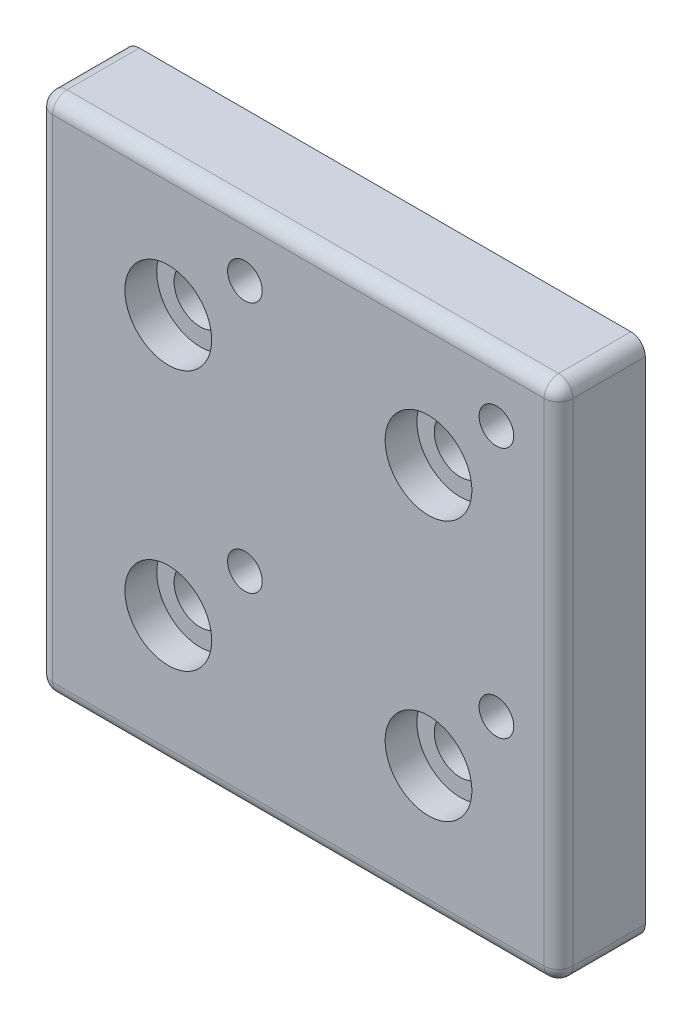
ISO-10303-21;
HEADER;
FILE_DESCRIPTION(('STEP AP214'),'2;1');
FILE_NAME('part.step','',(''),(''),'','','');
FILE_SCHEMA(('AUTOMOTIVE_DESIGN { 1 0 10303 214 1 1 1 1 }'));
ENDSEC;
DATA;
#1=APPLICATION_CONTEXT('core data for automotive mechanical design processes');
#2=APPLICATION_PROTOCOL_DEFINITION('international standard','automotive_design',2000,#1);
#3=PRODUCT_CONTEXT('',#1,'mechanical');
#4=PRODUCT('Part','Part','',(#3));
#5=PRODUCT_RELATED_PRODUCT_CATEGORY('part','',(#4));
#6=PRODUCT_DEFINITION_FORMATION('','',#4);
#7=PRODUCT_DEFINITION_CONTEXT('part definition',#1,'design');
#8=PRODUCT_DEFINITION('design','',#6,#7);
#9=PRODUCT_DEFINITION_SHAPE('','',#8);
#10=(LENGTH_UNIT() NAMED_UNIT(*) SI_UNIT(.MILLI.,.METRE.));
#11=(NAMED_UNIT(*) PLANE_ANGLE_UNIT() SI_UNIT($,.RADIAN.));
#12=(NAMED_UNIT(*) SI_UNIT($,.STERADIAN.) SOLID_ANGLE_UNIT());
#13=UNCERTAINTY_MEASURE_WITH_UNIT(LENGTH_MEASURE(1.E-05),#10,'distance_accuracy_value','');
#14=(GEOMETRIC_REPRESENTATION_CONTEXT(3) GLOBAL_UNCERTAINTY_ASSIGNED_CONTEXT((#13)) GLOBAL_UNIT_ASSIGNED_CONTEXT((#10,
#11,#12)) REPRESENTATION_CONTEXT('',''));
#15=CARTESIAN_POINT('',(0.,0.,0.));
#16=DIRECTION('',(0.,0.,1.));
#17=DIRECTION('',(1.,0.,0.));
#18=AXIS2_PLACEMENT_3D('',#15,#16,#17);
#19=CARTESIAN_POINT('',(-22.5,22.5,15.));
#20=DIRECTION('',(0.,0.,-1.));
#21=DIRECTION('',(-1.,0.,0.));
#22=AXIS2_PLACEMENT_3D('',#19,#20,#21);
#23=CYLINDRICAL_SURFACE('',#22,7.50000000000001);
#24=CARTESIAN_POINT('',(-22.5,22.5,9.5));
#25=DIRECTION('',(0.,0.,-1.));
#26=DIRECTION('',(-1.,0.,0.));
#27=AXIS2_PLACEMENT_3D('',#24,#25,#26);
#28=CIRCLE('',#27,7.50000000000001);
#29=CARTESIAN_POINT('',(-30.,22.5,9.5));
#30=VERTEX_POINT('',#29);
#31=EDGE_CURVE('E127',#30,#30,#28,.T.);
#32=ORIENTED_EDGE('',*,*,#31,.T.);
#33=EDGE_LOOP('',(#32));
#34=FACE_BOUND('',#33,.T.);
#35=CARTESIAN_POINT('',(-22.5,22.5,15.));
#36=DIRECTION('',(0.,0.,-1.));
#37=DIRECTION('',(-1.,0.,0.));
#38=AXIS2_PLACEMENT_3D('',#35,#36,#37);
#39=CIRCLE('',#38,7.50000000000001);
#40=CARTESIAN_POINT('',(-30.,22.5,15.));
#41=VERTEX_POINT('',#40);
#42=EDGE_CURVE('E133',#41,#41,#39,.T.);
#43=ORIENTED_EDGE('',*,*,#42,.F.);
#44=EDGE_LOOP('',(#43));
#45=FACE_BOUND('',#44,.T.);
#46=ADVANCED_FACE('F15',(#34,#45),#23,.F.);
#47=CARTESIAN_POINT('',(22.5,22.5,15.));
#48=DIRECTION('',(0.,0.,-1.));
#49=DIRECTION('',(-1.,0.,0.));
#50=AXIS2_PLACEMENT_3D('',#47,#48,#49);
#51=CYLINDRICAL_SURFACE('',#50,7.5);
#52=CARTESIAN_POINT('',(22.5,22.5,9.5));
#53=DIRECTION('',(0.,0.,-1.));
#54=DIRECTION('',(-1.,0.,0.));
#55=AXIS2_PLACEMENT_3D('',#52,#53,#54);
#56=CIRCLE('',#55,7.5);
#57=CARTESIAN_POINT('',(15.,22.5,9.5));
#58=VERTEX_POINT('',#57);
#59=EDGE_CURVE('E124',#58,#58,#56,.T.);
#60=ORIENTED_EDGE('',*,*,#59,.T.);
#61=EDGE_LOOP('',(#60));
#62=FACE_BOUND('',#61,.T.);
#63=CARTESIAN_POINT('',(22.5,22.5,15.));
#64=DIRECTION('',(0.,0.,-1.));
#65=DIRECTION('',(-1.,0.,0.));
#66=AXIS2_PLACEMENT_3D('',#63,#64,#65);
#67=CIRCLE('',#66,7.5);
#68=CARTESIAN_POINT('',(15.,22.5,15.));
#69=VERTEX_POINT('',#68);
#70=EDGE_CURVE('E130',#69,#69,#67,.T.);
#71=ORIENTED_EDGE('',*,*,#70,.F.);
#72=EDGE_LOOP('',(#71));
#73=FACE_BOUND('',#72,.T.);
#74=ADVANCED_FACE('F418',(#62,#73),#51,.F.);
#75=CARTESIAN_POINT('',(-22.5,-22.5,15.));
#76=DIRECTION('',(0.,0.,-1.));
#77=DIRECTION('',(-1.,0.,0.));
#78=AXIS2_PLACEMENT_3D('',#75,#76,#77);
#79=CYLINDRICAL_SURFACE('',#78,7.50000000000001);
#80=CARTESIAN_POINT('',(-22.5,-22.5,9.5));
#81=DIRECTION('',(0.,0.,-1.));
#82=DIRECTION('',(-1.,0.,0.));
#83=AXIS2_PLACEMENT_3D('',#80,#81,#82);
#84=CIRCLE('',#83,7.50000000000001);
#85=CARTESIAN_POINT('',(-30.,-22.5,9.5));
#86=VERTEX_POINT('',#85);
#87=EDGE_CURVE('E121',#86,#86,#84,.T.);
#88=ORIENTED_EDGE('',*,*,#87,.T.);
#89=EDGE_LOOP('',(#88));
#90=FACE_BOUND('',#89,.T.);
#91=CARTESIAN_POINT('',(-22.5,-22.5,15.));
#92=DIRECTION('',(0.,0.,-1.));
#93=DIRECTION('',(-1.,0.,0.));
#94=AXIS2_PLACEMENT_3D('',#91,#92,#93);
#95=CIRCLE('',#94,7.50000000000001);
#96=CARTESIAN_POINT('',(-30.,-22.5,15.));
#97=VERTEX_POINT('',#96);
#98=EDGE_CURVE('E135',#97,#97,#95,.T.);
#99=ORIENTED_EDGE('',*,*,#98,.F.);
#100=EDGE_LOOP('',(#99));
#101=FACE_BOUND('',#100,.T.);
#102=ADVANCED_FACE('F412',(#90,#101),#79,.F.);
#103=CARTESIAN_POINT('',(22.5,-22.5,15.));
#104=DIRECTION('',(0.,0.,-1.));
#105=DIRECTION('',(-1.,0.,0.));
#106=AXIS2_PLACEMENT_3D('',#103,#104,#105);
#107=CYLINDRICAL_SURFACE('',#106,7.5);
#108=CARTESIAN_POINT('',(22.5,-22.5,9.5));
#109=DIRECTION('',(0.,0.,-1.));
#110=DIRECTION('',(-1.,0.,0.));
#111=AXIS2_PLACEMENT_3D('',#108,#109,#110);
#112=CIRCLE('',#111,7.5);
#113=CARTESIAN_POINT('',(15.,-22.5,9.5));
#114=VERTEX_POINT('',#113);
#115=EDGE_CURVE('E117',#114,#114,#112,.T.);
#116=ORIENTED_EDGE('',*,*,#115,.T.);
#117=EDGE_LOOP('',(#116));
#118=FACE_BOUND('',#117,.T.);
#119=CARTESIAN_POINT('',(22.5,-22.5,15.));
#120=DIRECTION('',(0.,0.,-1.));
#121=DIRECTION('',(-1.,0.,0.));
#122=AXIS2_PLACEMENT_3D('',#119,#120,#121);
#123=CIRCLE('',#122,7.5);
#124=CARTESIAN_POINT('',(15.,-22.5,15.));
#125=VERTEX_POINT('',#124);
#126=EDGE_CURVE('E19',#125,#125,#123,.T.);
#127=ORIENTED_EDGE('',*,*,#126,.F.);
#128=EDGE_LOOP('',(#127));
#129=FACE_BOUND('',#128,.T.);
#130=ADVANCED_FACE('F409',(#118,#129),#107,.F.);
#131=CARTESIAN_POINT('',(-22.5,42.5,12.5));
#132=DIRECTION('',(1.,0.,0.));
#133=DIRECTION('',(0.,0.,-1.));
#134=AXIS2_PLACEMENT_3D('',#131,#132,#133);
#135=CYLINDRICAL_SURFACE('',#134,2.5);
#136=CARTESIAN_POINT('',(-42.5,42.5,12.5));
#137=DIRECTION('',(1.,0.,0.));
#138=DIRECTION('',(0.,1.,0.));
#139=AXIS2_PLACEMENT_3D('',#136,#137,#138);
#140=CIRCLE('',#139,2.5);
#141=CARTESIAN_POINT('',(-42.5,42.5,15.));
#142=VERTEX_POINT('',#141);
#143=CARTESIAN_POINT('',(-42.5,45.,12.5));
#144=VERTEX_POINT('',#143);
#145=EDGE_CURVE('E275',#142,#144,#140,.F.);
#146=ORIENTED_EDGE('',*,*,#145,.F.);
#147=DIRECTION('',(1.,0.,0.));
#148=VECTOR('',#147,1.);
#149=CARTESIAN_POINT('',(0.,42.5,15.));
#150=LINE('',#149,#148);
#151=CARTESIAN_POINT('',(42.5,42.5,15.));
#152=VERTEX_POINT('',#151);
#153=EDGE_CURVE('E155',#152,#142,#150,.F.);
#154=ORIENTED_EDGE('',*,*,#153,.F.);
#155=CARTESIAN_POINT('',(42.5,42.5,12.5));
#156=DIRECTION('',(1.,0.,0.));
#157=DIRECTION('',(0.,1.,0.));
#158=AXIS2_PLACEMENT_3D('',#155,#156,#157);
#159=CIRCLE('',#158,2.5);
#160=CARTESIAN_POINT('',(42.5,45.,12.5));
#161=VERTEX_POINT('',#160);
#162=EDGE_CURVE('E328',#161,#152,#159,.T.);
#163=ORIENTED_EDGE('',*,*,#162,.F.);
#164=DIRECTION('',(1.,0.,0.));
#165=VECTOR('',#164,1.);
#166=CARTESIAN_POINT('',(-45.,45.,12.5));
#167=LINE('',#166,#165);
#168=EDGE_CURVE('E120',#144,#161,#167,.T.);
#169=ORIENTED_EDGE('',*,*,#168,.F.);
#170=EDGE_LOOP('',(#146,#154,#163,#169));
#171=FACE_BOUND('',#170,.T.);
#172=ADVANCED_FACE('F270',(#171),#135,.T.);
#173=CARTESIAN_POINT('',(-42.5,42.5,12.5));
#174=DIRECTION('',(1.,0.,0.));
#175=DIRECTION('',(0.,1.,0.));
#176=AXIS2_PLACEMENT_3D('',#173,#174,#175);
#177=SPHERICAL_SURFACE('',#176,2.5);
#178=ORIENTED_EDGE('',*,*,#145,.T.);
#179=CARTESIAN_POINT('',(-42.5,42.5,12.5));
#180=DIRECTION('',(0.,0.,1.));
#181=DIRECTION('',(1.,0.,0.));
#182=AXIS2_PLACEMENT_3D('',#179,#180,#181);
#183=CIRCLE('',#182,2.5);
#184=CARTESIAN_POINT('',(-45.,42.5,12.5));
#185=VERTEX_POINT('',#184);
#186=EDGE_CURVE('E213',#185,#144,#183,.F.);
#187=ORIENTED_EDGE('',*,*,#186,.F.);
#188=CARTESIAN_POINT('',(-42.5,42.5,12.5));
#189=DIRECTION('',(0.,1.,0.));
#190=DIRECTION('',(-1.,0.,0.));
#191=AXIS2_PLACEMENT_3D('',#188,#189,#190);
#192=CIRCLE('',#191,2.5);
#193=EDGE_CURVE('E277',#142,#185,#192,.F.);
#194=ORIENTED_EDGE('',*,*,#193,.F.);
#195=EDGE_LOOP('',(#178,#187,#194));
#196=FACE_BOUND('',#195,.T.);
#197=ADVANCED_FACE('F265',(#196),#177,.T.);
#198=CARTESIAN_POINT('',(-42.5,-22.5,12.5));
#199=DIRECTION('',(0.,1.,0.));
#200=DIRECTION('',(-1.,0.,0.));
#201=AXIS2_PLACEMENT_3D('',#198,#199,#200);
#202=CYLINDRICAL_SURFACE('',#201,2.5);
#203=CARTESIAN_POINT('',(-42.5,-42.5,12.5));
#204=DIRECTION('',(0.,-1.,0.));
#205=DIRECTION('',(1.,0.,0.));
#206=AXIS2_PLACEMENT_3D('',#203,#204,#205);
#207=CIRCLE('',#206,2.5);
#208=CARTESIAN_POINT('',(-42.5,-42.5,15.));
#209=VERTEX_POINT('',#208);
#210=CARTESIAN_POINT('',(-45.,-42.5,12.5));
#211=VERTEX_POINT('',#210);
#212=EDGE_CURVE('E253',#209,#211,#207,.T.);
#213=ORIENTED_EDGE('',*,*,#212,.F.);
#214=DIRECTION('',(0.,1.,0.));
#215=VECTOR('',#214,1.);
#216=CARTESIAN_POINT('',(-42.5,0.,15.));
#217=LINE('',#216,#215);
#218=EDGE_CURVE('E152',#142,#209,#217,.F.);
#219=ORIENTED_EDGE('',*,*,#218,.F.);
#220=ORIENTED_EDGE('',*,*,#193,.T.);
#221=DIRECTION('',(0.,1.,0.));
#222=VECTOR('',#221,1.);
#223=CARTESIAN_POINT('',(-45.,-45.,12.5));
#224=LINE('',#223,#222);
#225=EDGE_CURVE('E74',#211,#185,#224,.T.);
#226=ORIENTED_EDGE('',*,*,#225,.F.);
#227=EDGE_LOOP('',(#213,#219,#220,#226));
#228=FACE_BOUND('',#227,.T.);
#229=ADVANCED_FACE('F261',(#228),#202,.T.);
#230=CARTESIAN_POINT('',(-42.5,-42.5,12.5));
#231=DIRECTION('',(1.,0.,0.));
#232=DIRECTION('',(0.,1.,0.));
#233=AXIS2_PLACEMENT_3D('',#230,#231,#232);
#234=SPHERICAL_SURFACE('',#233,2.5);
#235=ORIENTED_EDGE('',*,*,#212,.T.);
#236=CARTESIAN_POINT('',(-42.5,-42.5,12.5));
#237=DIRECTION('',(0.,0.,1.));
#238=DIRECTION('',(1.,0.,0.));
#239=AXIS2_PLACEMENT_3D('',#236,#237,#238);
#240=CIRCLE('',#239,2.5);
#241=CARTESIAN_POINT('',(-42.5,-45.,12.5));
#242=VERTEX_POINT('',#241);
#243=EDGE_CURVE('E210',#242,#211,#240,.F.);
#244=ORIENTED_EDGE('',*,*,#243,.F.);
#245=CARTESIAN_POINT('',(-42.5,-42.5,12.5));
#246=DIRECTION('',(-1.,0.,0.));
#247=DIRECTION('',(0.,-1.,0.));
#248=AXIS2_PLACEMENT_3D('',#245,#246,#247);
#249=CIRCLE('',#248,2.5);
#250=EDGE_CURVE('E248',#209,#242,#249,.F.);
#251=ORIENTED_EDGE('',*,*,#250,.F.);
#252=EDGE_LOOP('',(#235,#244,#251));
#253=FACE_BOUND('',#252,.T.);
#254=ADVANCED_FACE('F258',(#253),#234,.T.);
#255=CARTESIAN_POINT('',(22.5,-42.5,12.5));
#256=DIRECTION('',(-1.,0.,0.));
#257=DIRECTION('',(0.,-1.,0.));
#258=AXIS2_PLACEMENT_3D('',#255,#256,#257);
#259=CYLINDRICAL_SURFACE('',#258,2.5);
#260=CARTESIAN_POINT('',(42.5,-42.5,12.5));
#261=DIRECTION('',(1.,0.,0.));
#262=DIRECTION('',(0.,1.,0.));
#263=AXIS2_PLACEMENT_3D('',#260,#261,#262);
#264=CIRCLE('',#263,2.5);
#265=CARTESIAN_POINT('',(42.5,-42.5,15.));
#266=VERTEX_POINT('',#265);
#267=CARTESIAN_POINT('',(42.5,-45.,12.5));
#268=VERTEX_POINT('',#267);
#269=EDGE_CURVE('E244',#266,#268,#264,.T.);
#270=ORIENTED_EDGE('',*,*,#269,.F.);
#271=DIRECTION('',(1.,0.,0.));
#272=VECTOR('',#271,1.);
#273=CARTESIAN_POINT('',(0.,-42.5,15.));
#274=LINE('',#273,#272);
#275=EDGE_CURVE('E144',#209,#266,#274,.T.);
#276=ORIENTED_EDGE('',*,*,#275,.F.);
#277=ORIENTED_EDGE('',*,*,#250,.T.);
#278=DIRECTION('',(1.,0.,0.));
#279=VECTOR('',#278,1.);
#280=CARTESIAN_POINT('',(45.,-45.,12.5));
#281=LINE('',#280,#279);
#282=EDGE_CURVE('E208',#268,#242,#281,.F.);
#283=ORIENTED_EDGE('',*,*,#282,.F.);
#284=EDGE_LOOP('',(#270,#276,#277,#283));
#285=FACE_BOUND('',#284,.T.);
#286=ADVANCED_FACE('F237',(#285),#259,.T.);
#287=CARTESIAN_POINT('',(42.5,-42.5,12.5));
#288=DIRECTION('',(1.,0.,0.));
#289=DIRECTION('',(0.,1.,0.));
#290=AXIS2_PLACEMENT_3D('',#287,#288,#289);
#291=SPHERICAL_SURFACE('',#290,2.5);
#292=CARTESIAN_POINT('',(42.5,-42.5,12.5));
#293=DIRECTION('',(0.,-1.,0.));
#294=DIRECTION('',(0.,0.,-1.));
#295=AXIS2_PLACEMENT_3D('',#292,#293,#294);
#296=CIRCLE('',#295,2.5);
#297=CARTESIAN_POINT('',(45.,-42.5,12.5));
#298=VERTEX_POINT('',#297);
#299=EDGE_CURVE('E247',#266,#298,#296,.F.);
#300=ORIENTED_EDGE('',*,*,#299,.F.);
#301=ORIENTED_EDGE('',*,*,#269,.T.);
#302=CARTESIAN_POINT('',(42.5,-42.5,12.5));
#303=DIRECTION('',(0.,0.,1.));
#304=DIRECTION('',(1.,0.,0.));
#305=AXIS2_PLACEMENT_3D('',#302,#303,#304);
#306=CIRCLE('',#305,2.5);
#307=EDGE_CURVE('E205',#298,#268,#306,.F.);
#308=ORIENTED_EDGE('',*,*,#307,.F.);
#309=EDGE_LOOP('',(#300,#301,#308));
#310=FACE_BOUND('',#309,.T.);
#311=ADVANCED_FACE('F232',(#310),#291,.T.);
#312=CARTESIAN_POINT('',(42.5,22.5,12.5));
#313=DIRECTION('',(0.,-1.,0.));
#314=DIRECTION('',(0.,0.,-1.));
#315=AXIS2_PLACEMENT_3D('',#312,#313,#314);
#316=CYLINDRICAL_SURFACE('',#315,2.5);
#317=CARTESIAN_POINT('',(42.5,42.5,12.5));
#318=DIRECTION('',(0.,-1.,0.));
#319=DIRECTION('',(1.,0.,0.));
#320=AXIS2_PLACEMENT_3D('',#317,#318,#319);
#321=CIRCLE('',#320,2.5);
#322=CARTESIAN_POINT('',(45.,42.5,12.5));
#323=VERTEX_POINT('',#322);
#324=EDGE_CURVE('E219',#152,#323,#321,.F.);
#325=ORIENTED_EDGE('',*,*,#324,.F.);
#326=DIRECTION('',(0.,1.,0.));
#327=VECTOR('',#326,1.);
#328=CARTESIAN_POINT('',(42.5,0.,15.));
#329=LINE('',#328,#327);
#330=EDGE_CURVE('E140',#266,#152,#329,.T.);
#331=ORIENTED_EDGE('',*,*,#330,.F.);
#332=ORIENTED_EDGE('',*,*,#299,.T.);
#333=DIRECTION('',(0.,1.,0.));
#334=VECTOR('',#333,1.);
#335=CARTESIAN_POINT('',(45.,45.,12.5));
#336=LINE('',#335,#334);
#337=EDGE_CURVE('E202',#323,#298,#336,.F.);
#338=ORIENTED_EDGE('',*,*,#337,.F.);
#339=EDGE_LOOP('',(#325,#331,#332,#338));
#340=FACE_BOUND('',#339,.T.);
#341=ADVANCED_FACE('F227',(#340),#316,.T.);
#342=CARTESIAN_POINT('',(42.5,42.5,12.5));
#343=DIRECTION('',(1.,0.,0.));
#344=DIRECTION('',(0.,1.,0.));
#345=AXIS2_PLACEMENT_3D('',#342,#343,#344);
#346=SPHERICAL_SURFACE('',#345,2.5);
#347=ORIENTED_EDGE('',*,*,#162,.T.);
#348=ORIENTED_EDGE('',*,*,#324,.T.);
#349=CARTESIAN_POINT('',(42.5,42.5,12.5));
#350=DIRECTION('',(0.,0.,1.));
#351=DIRECTION('',(1.,0.,0.));
#352=AXIS2_PLACEMENT_3D('',#349,#350,#351);
#353=CIRCLE('',#352,2.5);
#354=EDGE_CURVE('E196',#161,#323,#353,.F.);
#355=ORIENTED_EDGE('',*,*,#354,.F.);
#356=EDGE_LOOP('',(#347,#348,#355));
#357=FACE_BOUND('',#356,.T.);
#358=ADVANCED_FACE('F222',(#357),#346,.T.);
#359=CARTESIAN_POINT('',(0.,0.,15.));
#360=DIRECTION('',(0.,0.,1.));
#361=DIRECTION('',(1.,0.,0.));
#362=AXIS2_PLACEMENT_3D('',#359,#360,#361);
#363=PLANE('',#362);
#364=ORIENTED_EDGE('',*,*,#70,.T.);
#365=EDGE_LOOP('',(#364));
#366=FACE_BOUND('',#365,.T.);
#367=ORIENTED_EDGE('',*,*,#42,.T.);
#368=EDGE_LOOP('',(#367));
#369=FACE_BOUND('',#368,.T.);
#370=ORIENTED_EDGE('',*,*,#98,.T.);
#371=EDGE_LOOP('',(#370));
#372=FACE_BOUND('',#371,.T.);
#373=ORIENTED_EDGE('',*,*,#126,.T.);
#374=EDGE_LOOP('',(#373));
#375=FACE_BOUND('',#374,.T.);
#376=CARTESIAN_POINT('',(34.25,34.25,15.));
#377=DIRECTION('',(0.,0.,1.));
#378=DIRECTION('',(1.,0.,0.));
#379=AXIS2_PLACEMENT_3D('',#376,#377,#378);
#380=CIRCLE('',#379,3.);
#381=CARTESIAN_POINT('',(37.25,34.25,15.));
#382=VERTEX_POINT('',#381);
#383=EDGE_CURVE('E105',#382,#382,#380,.F.);
#384=ORIENTED_EDGE('',*,*,#383,.T.);
#385=EDGE_LOOP('',(#384));
#386=FACE_BOUND('',#385,.T.);
#387=CARTESIAN_POINT('',(34.25,-9.25000000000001,15.));
#388=DIRECTION('',(0.,0.,1.));
#389=DIRECTION('',(1.,0.,0.));
#390=AXIS2_PLACEMENT_3D('',#387,#388,#389);
#391=CIRCLE('',#390,3.);
#392=CARTESIAN_POINT('',(37.25,-9.25000000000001,15.));
#393=VERTEX_POINT('',#392);
#394=EDGE_CURVE('E108',#393,#393,#391,.F.);
#395=ORIENTED_EDGE('',*,*,#394,.T.);
#396=EDGE_LOOP('',(#395));
#397=FACE_BOUND('',#396,.T.);
#398=CARTESIAN_POINT('',(-9.25000000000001,-9.25000000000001,15.));
#399=DIRECTION('',(0.,0.,1.));
#400=DIRECTION('',(1.,0.,0.));
#401=AXIS2_PLACEMENT_3D('',#398,#399,#400);
#402=CIRCLE('',#401,3.);
#403=CARTESIAN_POINT('',(-6.25000000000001,-9.25000000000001,15.));
#404=VERTEX_POINT('',#403);
#405=EDGE_CURVE('E111',#404,#404,#402,.F.);
#406=ORIENTED_EDGE('',*,*,#405,.T.);
#407=EDGE_LOOP('',(#406));
#408=FACE_BOUND('',#407,.T.);
#409=CARTESIAN_POINT('',(-9.25000000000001,34.25,15.));
#410=DIRECTION('',(0.,0.,1.));
#411=DIRECTION('',(1.,0.,0.));
#412=AXIS2_PLACEMENT_3D('',#409,#410,#411);
#413=CIRCLE('',#412,3.);
#414=CARTESIAN_POINT('',(-6.25000000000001,34.25,15.));
#415=VERTEX_POINT('',#414);
#416=EDGE_CURVE('E114',#415,#415,#413,.F.);
#417=ORIENTED_EDGE('',*,*,#416,.T.);
#418=EDGE_LOOP('',(#417));
#419=FACE_BOUND('',#418,.T.);
#420=ORIENTED_EDGE('',*,*,#275,.T.);
#421=ORIENTED_EDGE('',*,*,#330,.T.);
#422=ORIENTED_EDGE('',*,*,#153,.T.);
#423=ORIENTED_EDGE('',*,*,#218,.T.);
#424=EDGE_LOOP('',(#420,#421,#422,#423));
#425=FACE_BOUND('',#424,.T.);
#426=ADVANCED_FACE('F226',(#366,#369,#372,#375,#386,#397,#408,#419,#425),#363,.T.);
#427=CARTESIAN_POINT('',(-30.15,30.15,9.5));
#428=DIRECTION('',(0.,0.,-1.));
#429=DIRECTION('',(1.,0.,0.));
#430=AXIS2_PLACEMENT_3D('',#427,#428,#429);
#431=PLANE('',#430);
#432=CARTESIAN_POINT('',(-22.5,22.5,9.5));
#433=DIRECTION('',(0.,0.,1.));
#434=DIRECTION('',(1.,0.,0.));
#435=AXIS2_PLACEMENT_3D('',#432,#433,#434);
#436=CIRCLE('',#435,4.5);
#437=CARTESIAN_POINT('',(-18.,22.5,9.5));
#438=VERTEX_POINT('',#437);
#439=EDGE_CURVE('E102',#438,#438,#436,.F.);
#440=ORIENTED_EDGE('',*,*,#439,.T.);
#441=EDGE_LOOP('',(#440));
#442=FACE_BOUND('',#441,.T.);
#443=ORIENTED_EDGE('',*,*,#31,.F.);
#444=EDGE_LOOP('',(#443));
#445=FACE_BOUND('',#444,.T.);
#446=ADVANCED_FACE('F423',(#442,#445),#431,.F.);
#447=CARTESIAN_POINT('',(14.85,30.15,9.5));
#448=DIRECTION('',(0.,0.,-1.));
#449=DIRECTION('',(1.,0.,0.));
#450=AXIS2_PLACEMENT_3D('',#447,#448,#449);
#451=PLANE('',#450);
#452=CARTESIAN_POINT('',(22.5,22.5,9.5));
#453=DIRECTION('',(0.,0.,1.));
#454=DIRECTION('',(1.,0.,0.));
#455=AXIS2_PLACEMENT_3D('',#452,#453,#454);
#456=CIRCLE('',#455,4.5);
#457=CARTESIAN_POINT('',(27.,22.5,9.5));
#458=VERTEX_POINT('',#457);
#459=EDGE_CURVE('E99',#458,#458,#456,.F.);
#460=ORIENTED_EDGE('',*,*,#459,.T.);
#461=EDGE_LOOP('',(#460));
#462=FACE_BOUND('',#461,.T.);
#463=ORIENTED_EDGE('',*,*,#59,.F.);
#464=EDGE_LOOP('',(#463));
#465=FACE_BOUND('',#464,.T.);
#466=ADVANCED_FACE('F403',(#462,#465),#451,.F.);
#467=CARTESIAN_POINT('',(-30.15,-14.85,9.5));
#468=DIRECTION('',(0.,0.,-1.));
#469=DIRECTION('',(1.,0.,0.));
#470=AXIS2_PLACEMENT_3D('',#467,#468,#469);
#471=PLANE('',#470);
#472=CARTESIAN_POINT('',(-22.5,-22.5,9.5));
#473=DIRECTION('',(0.,0.,1.));
#474=DIRECTION('',(1.,0.,0.));
#475=AXIS2_PLACEMENT_3D('',#472,#473,#474);
#476=CIRCLE('',#475,4.5);
#477=CARTESIAN_POINT('',(-18.,-22.5,9.5));
#478=VERTEX_POINT('',#477);
#479=EDGE_CURVE('E96',#478,#478,#476,.F.);
#480=ORIENTED_EDGE('',*,*,#479,.T.);
#481=EDGE_LOOP('',(#480));
#482=FACE_BOUND('',#481,.T.);
#483=ORIENTED_EDGE('',*,*,#87,.F.);
#484=EDGE_LOOP('',(#483));
#485=FACE_BOUND('',#484,.T.);
#486=ADVANCED_FACE('F398',(#482,#485),#471,.F.);
#487=CARTESIAN_POINT('',(14.85,-14.85,9.5));
#488=DIRECTION('',(0.,0.,-1.));
#489=DIRECTION('',(1.,0.,0.));
#490=AXIS2_PLACEMENT_3D('',#487,#488,#489);
#491=PLANE('',#490);
#492=CARTESIAN_POINT('',(22.5,-22.5,9.5));
#493=DIRECTION('',(0.,0.,1.));
#494=DIRECTION('',(1.,0.,0.));
#495=AXIS2_PLACEMENT_3D('',#492,#493,#494);
#496=CIRCLE('',#495,4.5);
#497=CARTESIAN_POINT('',(27.,-22.5,9.5));
#498=VERTEX_POINT('',#497);
#499=EDGE_CURVE('E89',#498,#498,#496,.F.);
#500=ORIENTED_EDGE('',*,*,#499,.T.);
#501=EDGE_LOOP('',(#500));
#502=FACE_BOUND('',#501,.T.);
#503=ORIENTED_EDGE('',*,*,#115,.F.);
#504=EDGE_LOOP('',(#503));
#505=FACE_BOUND('',#504,.T.);
#506=ADVANCED_FACE('F17',(#502,#505),#491,.F.);
#507=CARTESIAN_POINT('',(-45.,45.,0.));
#508=DIRECTION('',(0.,1.,0.));
#509=DIRECTION('',(0.,0.,1.));
#510=AXIS2_PLACEMENT_3D('',#507,#508,#509);
#511=PLANE('',#510);
#512=DIRECTION('',(0.,0.,1.));
#513=VECTOR('',#512,1.);
#514=CARTESIAN_POINT('',(-42.5,45.,0.));
#515=LINE('',#514,#513);
#516=CARTESIAN_POINT('',(-42.5,45.,0.));
#517=VERTEX_POINT('',#516);
#518=EDGE_CURVE('E60',#144,#517,#515,.F.);
#519=ORIENTED_EDGE('',*,*,#518,.F.);
#520=ORIENTED_EDGE('',*,*,#168,.T.);
#521=DIRECTION('',(0.,0.,1.));
#522=VECTOR('',#521,1.);
#523=CARTESIAN_POINT('',(42.5,45.,0.));
#524=LINE('',#523,#522);
#525=CARTESIAN_POINT('',(42.5,45.,0.));
#526=VERTEX_POINT('',#525);
#527=EDGE_CURVE('E197',#526,#161,#524,.T.);
#528=ORIENTED_EDGE('',*,*,#527,.F.);
#529=DIRECTION('',(1.,0.,0.));
#530=VECTOR('',#529,1.);
#531=CARTESIAN_POINT('',(0.,45.,0.));
#532=LINE('',#531,#530);
#533=EDGE_CURVE('E87',#526,#517,#532,.F.);
#534=ORIENTED_EDGE('',*,*,#533,.T.);
#535=EDGE_LOOP('',(#519,#520,#528,#534));
#536=FACE_BOUND('',#535,.T.);
#537=ADVANCED_FACE('F393',(#536),#511,.T.);
#538=CARTESIAN_POINT('',(-42.5,42.5,0.));
#539=DIRECTION('',(0.,0.,1.));
#540=DIRECTION('',(1.,0.,0.));
#541=AXIS2_PLACEMENT_3D('',#538,#539,#540);
#542=CYLINDRICAL_SURFACE('',#541,2.5);
#543=ORIENTED_EDGE('',*,*,#186,.T.);
#544=ORIENTED_EDGE('',*,*,#518,.T.);
#545=CARTESIAN_POINT('',(-42.5,42.5,0.));
#546=DIRECTION('',(0.,0.,1.));
#547=DIRECTION('',(1.,0.,0.));
#548=AXIS2_PLACEMENT_3D('',#545,#546,#547);
#549=CIRCLE('',#548,2.5);
#550=CARTESIAN_POINT('',(-45.,42.5,0.));
#551=VERTEX_POINT('',#550);
#552=EDGE_CURVE('E80',#517,#551,#549,.T.);
#553=ORIENTED_EDGE('',*,*,#552,.T.);
#554=DIRECTION('',(0.,0.,1.));
#555=VECTOR('',#554,1.);
#556=CARTESIAN_POINT('',(-45.,42.5,0.));
#557=LINE('',#556,#555);
#558=EDGE_CURVE('E67',#185,#551,#557,.F.);
#559=ORIENTED_EDGE('',*,*,#558,.F.);
#560=EDGE_LOOP('',(#543,#544,#553,#559));
#561=FACE_BOUND('',#560,.T.);
#562=ADVANCED_FACE('F86',(#561),#542,.T.);
#563=CARTESIAN_POINT('',(-45.,-45.,0.));
#564=DIRECTION('',(-1.,0.,0.));
#565=DIRECTION('',(0.,0.,1.));
#566=AXIS2_PLACEMENT_3D('',#563,#564,#565);
#567=PLANE('',#566);
#568=DIRECTION('',(0.,0.,1.));
#569=VECTOR('',#568,1.);
#570=CARTESIAN_POINT('',(-45.,-42.5,0.));
#571=LINE('',#570,#569);
#572=CARTESIAN_POINT('',(-45.,-42.5,0.));
#573=VERTEX_POINT('',#572);
#574=EDGE_CURVE('E209',#211,#573,#571,.F.);
#575=ORIENTED_EDGE('',*,*,#574,.F.);
#576=ORIENTED_EDGE('',*,*,#225,.T.);
#577=ORIENTED_EDGE('',*,*,#558,.T.);
#578=DIRECTION('',(0.,1.,0.));
#579=VECTOR('',#578,1.);
#580=CARTESIAN_POINT('',(-45.,0.,0.));
#581=LINE('',#580,#579);
#582=EDGE_CURVE('E71',#551,#573,#581,.F.);
#583=ORIENTED_EDGE('',*,*,#582,.T.);
#584=EDGE_LOOP('',(#575,#576,#577,#583));
#585=FACE_BOUND('',#584,.T.);
#586=ADVANCED_FACE('F70',(#585),#567,.T.);
#587=CARTESIAN_POINT('',(-42.5,-42.5,0.));
#588=DIRECTION('',(0.,0.,1.));
#589=DIRECTION('',(1.,0.,0.));
#590=AXIS2_PLACEMENT_3D('',#587,#588,#589);
#591=CYLINDRICAL_SURFACE('',#590,2.5);
#592=ORIENTED_EDGE('',*,*,#243,.T.);
#593=ORIENTED_EDGE('',*,*,#574,.T.);
#594=CARTESIAN_POINT('',(-42.5,-42.5,0.));
#595=DIRECTION('',(0.,0.,1.));
#596=DIRECTION('',(1.,0.,0.));
#597=AXIS2_PLACEMENT_3D('',#594,#595,#596);
#598=CIRCLE('',#597,2.5);
#599=CARTESIAN_POINT('',(-42.5,-45.,0.));
#600=VERTEX_POINT('',#599);
#601=EDGE_CURVE('E84',#573,#600,#598,.T.);
#602=ORIENTED_EDGE('',*,*,#601,.T.);
#603=DIRECTION('',(0.,0.,-1.));
#604=VECTOR('',#603,1.);
#605=CARTESIAN_POINT('',(-42.5,-45.,0.));
#606=LINE('',#605,#604);
#607=EDGE_CURVE('E206',#242,#600,#606,.T.);
#608=ORIENTED_EDGE('',*,*,#607,.F.);
#609=EDGE_LOOP('',(#592,#593,#602,#608));
#610=FACE_BOUND('',#609,.T.);
#611=ADVANCED_FACE('F295',(#610),#591,.T.);
#612=CARTESIAN_POINT('',(45.,-45.,0.));
#613=DIRECTION('',(0.,-1.,0.));
#614=DIRECTION('',(0.,0.,-1.));
#615=AXIS2_PLACEMENT_3D('',#612,#613,#614);
#616=PLANE('',#615);
#617=ORIENTED_EDGE('',*,*,#607,.T.);
#618=DIRECTION('',(1.,0.,0.));
#619=VECTOR('',#618,1.);
#620=CARTESIAN_POINT('',(0.,-45.,0.));
#621=LINE('',#620,#619);
#622=CARTESIAN_POINT('',(42.5,-45.,0.));
#623=VERTEX_POINT('',#622);
#624=EDGE_CURVE('E184',#600,#623,#621,.T.);
#625=ORIENTED_EDGE('',*,*,#624,.T.);
#626=DIRECTION('',(0.,0.,1.));
#627=VECTOR('',#626,1.);
#628=CARTESIAN_POINT('',(42.5,-45.,0.));
#629=LINE('',#628,#627);
#630=EDGE_CURVE('E203',#268,#623,#629,.F.);
#631=ORIENTED_EDGE('',*,*,#630,.F.);
#632=ORIENTED_EDGE('',*,*,#282,.T.);
#633=EDGE_LOOP('',(#617,#625,#631,#632));
#634=FACE_BOUND('',#633,.T.);
#635=ADVANCED_FACE('F299',(#634),#616,.T.);
#636=CARTESIAN_POINT('',(42.5,-42.5,0.));
#637=DIRECTION('',(0.,0.,1.));
#638=DIRECTION('',(1.,0.,0.));
#639=AXIS2_PLACEMENT_3D('',#636,#637,#638);
#640=CYLINDRICAL_SURFACE('',#639,2.5);
#641=ORIENTED_EDGE('',*,*,#307,.T.);
#642=ORIENTED_EDGE('',*,*,#630,.T.);
#643=CARTESIAN_POINT('',(42.5,-42.5,0.));
#644=DIRECTION('',(0.,0.,1.));
#645=DIRECTION('',(1.,0.,0.));
#646=AXIS2_PLACEMENT_3D('',#643,#644,#645);
#647=CIRCLE('',#646,2.5);
#648=CARTESIAN_POINT('',(45.,-42.5,0.));
#649=VERTEX_POINT('',#648);
#650=EDGE_CURVE('E182',#623,#649,#647,.T.);
#651=ORIENTED_EDGE('',*,*,#650,.T.);
#652=DIRECTION('',(0.,0.,-1.));
#653=VECTOR('',#652,1.);
#654=CARTESIAN_POINT('',(45.,-42.5,0.));
#655=LINE('',#654,#653);
#656=EDGE_CURVE('E200',#298,#649,#655,.T.);
#657=ORIENTED_EDGE('',*,*,#656,.F.);
#658=EDGE_LOOP('',(#641,#642,#651,#657));
#659=FACE_BOUND('',#658,.T.);
#660=ADVANCED_FACE('F307',(#659),#640,.T.);
#661=CARTESIAN_POINT('',(45.,45.,0.));
#662=DIRECTION('',(1.,0.,0.));
#663=DIRECTION('',(0.,0.,-1.));
#664=AXIS2_PLACEMENT_3D('',#661,#662,#663);
#665=PLANE('',#664);
#666=ORIENTED_EDGE('',*,*,#656,.T.);
#667=DIRECTION('',(0.,1.,0.));
#668=VECTOR('',#667,1.);
#669=CARTESIAN_POINT('',(45.,0.,0.));
#670=LINE('',#669,#668);
#671=CARTESIAN_POINT('',(45.,42.5,0.));
#672=VERTEX_POINT('',#671);
#673=EDGE_CURVE('E181',#649,#672,#670,.T.);
#674=ORIENTED_EDGE('',*,*,#673,.T.);
#675=DIRECTION('',(0.,0.,1.));
#676=VECTOR('',#675,1.);
#677=CARTESIAN_POINT('',(45.,42.5,0.));
#678=LINE('',#677,#676);
#679=EDGE_CURVE('E34',#323,#672,#678,.F.);
#680=ORIENTED_EDGE('',*,*,#679,.F.);
#681=ORIENTED_EDGE('',*,*,#337,.T.);
#682=EDGE_LOOP('',(#666,#674,#680,#681));
#683=FACE_BOUND('',#682,.T.);
#684=ADVANCED_FACE('F302',(#683),#665,.T.);
#685=CARTESIAN_POINT('',(42.5,42.5,0.));
#686=DIRECTION('',(0.,0.,1.));
#687=DIRECTION('',(1.,0.,0.));
#688=AXIS2_PLACEMENT_3D('',#685,#686,#687);
#689=CYLINDRICAL_SURFACE('',#688,2.5);
#690=ORIENTED_EDGE('',*,*,#354,.T.);
#691=ORIENTED_EDGE('',*,*,#679,.T.);
#692=CARTESIAN_POINT('',(42.5,42.5,0.));
#693=DIRECTION('',(0.,0.,1.));
#694=DIRECTION('',(1.,0.,0.));
#695=AXIS2_PLACEMENT_3D('',#692,#693,#694);
#696=CIRCLE('',#695,2.5);
#697=EDGE_CURVE('E180',#672,#526,#696,.T.);
#698=ORIENTED_EDGE('',*,*,#697,.T.);
#699=ORIENTED_EDGE('',*,*,#527,.T.);
#700=EDGE_LOOP('',(#690,#691,#698,#699));
#701=FACE_BOUND('',#700,.T.);
#702=ADVANCED_FACE('F330',(#701),#689,.T.);
#703=CARTESIAN_POINT('',(-9.25000000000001,34.25,0.));
#704=DIRECTION('',(0.,0.,1.));
#705=DIRECTION('',(1.,0.,0.));
#706=AXIS2_PLACEMENT_3D('',#703,#704,#705);
#707=CYLINDRICAL_SURFACE('',#706,3.);
#708=CARTESIAN_POINT('',(-9.25000000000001,34.25,0.));
#709=DIRECTION('',(0.,0.,1.));
#710=DIRECTION('',(1.,0.,0.));
#711=AXIS2_PLACEMENT_3D('',#708,#709,#710);
#712=CIRCLE('',#711,3.);
#713=CARTESIAN_POINT('',(-6.25000000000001,34.25,0.));
#714=VERTEX_POINT('',#713);
#715=EDGE_CURVE('E177',#714,#714,#712,.F.);
#716=ORIENTED_EDGE('',*,*,#715,.T.);
#717=EDGE_LOOP('',(#716));
#718=FACE_BOUND('',#717,.T.);
#719=ORIENTED_EDGE('',*,*,#416,.F.);
#720=EDGE_LOOP('',(#719));
#721=FACE_BOUND('',#720,.T.);
#722=ADVANCED_FACE('F375',(#718,#721),#707,.F.);
#723=CARTESIAN_POINT('',(-9.25000000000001,-9.25000000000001,0.));
#724=DIRECTION('',(0.,0.,1.));
#725=DIRECTION('',(1.,0.,0.));
#726=AXIS2_PLACEMENT_3D('',#723,#724,#725);
#727=CYLINDRICAL_SURFACE('',#726,3.);
#728=CARTESIAN_POINT('',(-9.25000000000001,-9.25000000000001,0.));
#729=DIRECTION('',(0.,0.,1.));
#730=DIRECTION('',(1.,0.,0.));
#731=AXIS2_PLACEMENT_3D('',#728,#729,#730);
#732=CIRCLE('',#731,3.);
#733=CARTESIAN_POINT('',(-6.25000000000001,-9.25000000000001,0.));
#734=VERTEX_POINT('',#733);
#735=EDGE_CURVE('E174',#734,#734,#732,.F.);
#736=ORIENTED_EDGE('',*,*,#735,.T.);
#737=EDGE_LOOP('',(#736));
#738=FACE_BOUND('',#737,.T.);
#739=ORIENTED_EDGE('',*,*,#405,.F.);
#740=EDGE_LOOP('',(#739));
#741=FACE_BOUND('',#740,.T.);
#742=ADVANCED_FACE('F371',(#738,#741),#727,.F.);
#743=CARTESIAN_POINT('',(34.25,-9.25000000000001,0.));
#744=DIRECTION('',(0.,0.,1.));
#745=DIRECTION('',(1.,0.,0.));
#746=AXIS2_PLACEMENT_3D('',#743,#744,#745);
#747=CYLINDRICAL_SURFACE('',#746,3.);
#748=CARTESIAN_POINT('',(34.25,-9.25000000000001,0.));
#749=DIRECTION('',(0.,0.,1.));
#750=DIRECTION('',(1.,0.,0.));
#751=AXIS2_PLACEMENT_3D('',#748,#749,#750);
#752=CIRCLE('',#751,3.);
#753=CARTESIAN_POINT('',(37.25,-9.25000000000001,0.));
#754=VERTEX_POINT('',#753);
#755=EDGE_CURVE('E171',#754,#754,#752,.F.);
#756=ORIENTED_EDGE('',*,*,#755,.T.);
#757=EDGE_LOOP('',(#756));
#758=FACE_BOUND('',#757,.T.);
#759=ORIENTED_EDGE('',*,*,#394,.F.);
#760=EDGE_LOOP('',(#759));
#761=FACE_BOUND('',#760,.T.);
#762=ADVANCED_FACE('F367',(#758,#761),#747,.F.);
#763=CARTESIAN_POINT('',(34.25,34.25,0.));
#764=DIRECTION('',(0.,0.,1.));
#765=DIRECTION('',(1.,0.,0.));
#766=AXIS2_PLACEMENT_3D('',#763,#764,#765);
#767=CYLINDRICAL_SURFACE('',#766,3.);
#768=CARTESIAN_POINT('',(34.25,34.25,0.));
#769=DIRECTION('',(0.,0.,1.));
#770=DIRECTION('',(1.,0.,0.));
#771=AXIS2_PLACEMENT_3D('',#768,#769,#770);
#772=CIRCLE('',#771,3.);
#773=CARTESIAN_POINT('',(37.25,34.25,0.));
#774=VERTEX_POINT('',#773);
#775=EDGE_CURVE('E168',#774,#774,#772,.F.);
#776=ORIENTED_EDGE('',*,*,#775,.T.);
#777=EDGE_LOOP('',(#776));
#778=FACE_BOUND('',#777,.T.);
#779=ORIENTED_EDGE('',*,*,#383,.F.);
#780=EDGE_LOOP('',(#779));
#781=FACE_BOUND('',#780,.T.);
#782=ADVANCED_FACE('F363',(#778,#781),#767,.F.);
#783=CARTESIAN_POINT('',(-22.5,22.5,0.));
#784=DIRECTION('',(0.,0.,1.));
#785=DIRECTION('',(1.,0.,0.));
#786=AXIS2_PLACEMENT_3D('',#783,#784,#785);
#787=CYLINDRICAL_SURFACE('',#786,4.5);
#788=CARTESIAN_POINT('',(-22.5,22.5,0.));
#789=DIRECTION('',(0.,0.,1.));
#790=DIRECTION('',(1.,0.,0.));
#791=AXIS2_PLACEMENT_3D('',#788,#789,#790);
#792=CIRCLE('',#791,4.5);
#793=CARTESIAN_POINT('',(-18.,22.5,0.));
#794=VERTEX_POINT('',#793);
#795=EDGE_CURVE('E165',#794,#794,#792,.F.);
#796=ORIENTED_EDGE('',*,*,#795,.T.);
#797=EDGE_LOOP('',(#796));
#798=FACE_BOUND('',#797,.T.);
#799=ORIENTED_EDGE('',*,*,#439,.F.);
#800=EDGE_LOOP('',(#799));
#801=FACE_BOUND('',#800,.T.);
#802=ADVANCED_FACE('F359',(#798,#801),#787,.F.);
#803=CARTESIAN_POINT('',(22.5,22.5,0.));
#804=DIRECTION('',(0.,0.,1.));
#805=DIRECTION('',(1.,0.,0.));
#806=AXIS2_PLACEMENT_3D('',#803,#804,#805);
#807=CYLINDRICAL_SURFACE('',#806,4.5);
#808=CARTESIAN_POINT('',(22.5,22.5,0.));
#809=DIRECTION('',(0.,0.,1.));
#810=DIRECTION('',(1.,0.,0.));
#811=AXIS2_PLACEMENT_3D('',#808,#809,#810);
#812=CIRCLE('',#811,4.5);
#813=CARTESIAN_POINT('',(27.,22.5,0.));
#814=VERTEX_POINT('',#813);
#815=EDGE_CURVE('E162',#814,#814,#812,.F.);
#816=ORIENTED_EDGE('',*,*,#815,.T.);
#817=EDGE_LOOP('',(#816));
#818=FACE_BOUND('',#817,.T.);
#819=ORIENTED_EDGE('',*,*,#459,.F.);
#820=EDGE_LOOP('',(#819));
#821=FACE_BOUND('',#820,.T.);
#822=ADVANCED_FACE('F355',(#818,#821),#807,.F.);
#823=CARTESIAN_POINT('',(-22.5,-22.5,0.));
#824=DIRECTION('',(0.,0.,1.));
#825=DIRECTION('',(1.,0.,0.));
#826=AXIS2_PLACEMENT_3D('',#823,#824,#825);
#827=CYLINDRICAL_SURFACE('',#826,4.5);
#828=CARTESIAN_POINT('',(-22.5,-22.5,0.));
#829=DIRECTION('',(0.,0.,1.));
#830=DIRECTION('',(1.,0.,0.));
#831=AXIS2_PLACEMENT_3D('',#828,#829,#830);
#832=CIRCLE('',#831,4.5);
#833=CARTESIAN_POINT('',(-18.,-22.5,0.));
#834=VERTEX_POINT('',#833);
#835=EDGE_CURVE('E25',#834,#834,#832,.F.);
#836=ORIENTED_EDGE('',*,*,#835,.T.);
#837=EDGE_LOOP('',(#836));
#838=FACE_BOUND('',#837,.T.);
#839=ORIENTED_EDGE('',*,*,#479,.F.);
#840=EDGE_LOOP('',(#839));
#841=FACE_BOUND('',#840,.T.);
#842=ADVANCED_FACE('F347',(#838,#841),#827,.F.);
#843=CARTESIAN_POINT('',(22.5,-22.5,0.));
#844=DIRECTION('',(0.,0.,1.));
#845=DIRECTION('',(1.,0.,0.));
#846=AXIS2_PLACEMENT_3D('',#843,#844,#845);
#847=CYLINDRICAL_SURFACE('',#846,4.5);
#848=CARTESIAN_POINT('',(22.5,-22.5,0.));
#849=DIRECTION('',(0.,0.,1.));
#850=DIRECTION('',(1.,0.,0.));
#851=AXIS2_PLACEMENT_3D('',#848,#849,#850);
#852=CIRCLE('',#851,4.5);
#853=CARTESIAN_POINT('',(27.,-22.5,0.));
#854=VERTEX_POINT('',#853);
#855=EDGE_CURVE('E10',#854,#854,#852,.F.);
#856=ORIENTED_EDGE('',*,*,#855,.T.);
#857=EDGE_LOOP('',(#856));
#858=FACE_BOUND('',#857,.T.);
#859=ORIENTED_EDGE('',*,*,#499,.F.);
#860=EDGE_LOOP('',(#859));
#861=FACE_BOUND('',#860,.T.);
#862=ADVANCED_FACE('F341',(#858,#861),#847,.F.);
#863=CARTESIAN_POINT('',(0.,0.,0.));
#864=DIRECTION('',(0.,0.,1.));
#865=DIRECTION('',(1.,0.,0.));
#866=AXIS2_PLACEMENT_3D('',#863,#864,#865);
#867=PLANE('',#866);
#868=ORIENTED_EDGE('',*,*,#855,.F.);
#869=EDGE_LOOP('',(#868));
#870=FACE_BOUND('',#869,.T.);
#871=ORIENTED_EDGE('',*,*,#835,.F.);
#872=EDGE_LOOP('',(#871));
#873=FACE_BOUND('',#872,.T.);
#874=ORIENTED_EDGE('',*,*,#815,.F.);
#875=EDGE_LOOP('',(#874));
#876=FACE_BOUND('',#875,.T.);
#877=ORIENTED_EDGE('',*,*,#795,.F.);
#878=EDGE_LOOP('',(#877));
#879=FACE_BOUND('',#878,.T.);
#880=ORIENTED_EDGE('',*,*,#775,.F.);
#881=EDGE_LOOP('',(#880));
#882=FACE_BOUND('',#881,.T.);
#883=ORIENTED_EDGE('',*,*,#755,.F.);
#884=EDGE_LOOP('',(#883));
#885=FACE_BOUND('',#884,.T.);
#886=ORIENTED_EDGE('',*,*,#735,.F.);
#887=EDGE_LOOP('',(#886));
#888=FACE_BOUND('',#887,.T.);
#889=ORIENTED_EDGE('',*,*,#715,.F.);
#890=EDGE_LOOP('',(#889));
#891=FACE_BOUND('',#890,.T.);
#892=ORIENTED_EDGE('',*,*,#673,.F.);
#893=ORIENTED_EDGE('',*,*,#650,.F.);
#894=ORIENTED_EDGE('',*,*,#624,.F.);
#895=ORIENTED_EDGE('',*,*,#601,.F.);
#896=ORIENTED_EDGE('',*,*,#582,.F.);
#897=ORIENTED_EDGE('',*,*,#552,.F.);
#898=ORIENTED_EDGE('',*,*,#533,.F.);
#899=ORIENTED_EDGE('',*,*,#697,.F.);
#900=EDGE_LOOP('',(#892,#893,#894,#895,#896,#897,#898,#899));
#901=FACE_BOUND('',#900,.T.);
#902=ADVANCED_FACE('F79',(#870,#873,#876,#879,#882,#885,#888,#891,#901),#867,.F.);
#903=CLOSED_SHELL('',(#46,#74,#102,#130,#172,#197,#229,#254,#286,#311,#341,#358,#426,#446,#466,
#486,#506,#537,#562,#586,#611,#635,#660,#684,#702,#722,#742,#762,#782,#802,#822,#842,#862,#902));
#904=MANIFOLD_SOLID_BREP('B1',#903);
#905=ADVANCED_BREP_SHAPE_REPRESENTATION('',(#18,#904),#14);
#906=SHAPE_DEFINITION_REPRESENTATION(#9,#905);
ENDSEC;
END-ISO-10303-21;
